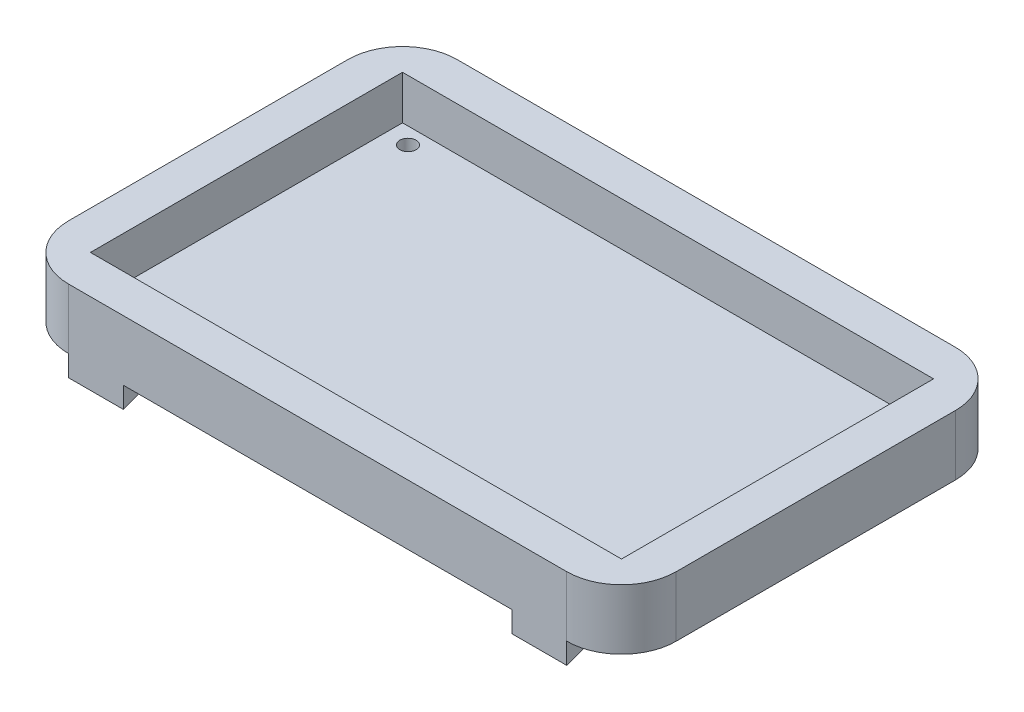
from build123d import *

# Parameters (mm, degrees)
ESQUISSE1_W             = 97
ESQUISSE1_H             = 57
BOSS_EXTRU_1_DEPTH      = 3
ESQUISSE3_W             = 7
ESQUISSE3_H             = 57
BOSS_EXTRU_2_DEPTH      = 11
ESQUISSE4_W             = 104
ESQUISSE4_H             = 7
BOSS_EXTRU_3_DEPTH      = 11
ESQUISSE5_W             = 104
ESQUISSE5_H             = 7
BOSS_EXTRU_4_DEPTH      = 11
ESQUISSE6_W             = 7
ESQUISSE6_H             = 71
BOSS_EXTRU_5_DEPTH      = 11
ESQUISSE7_R             = 1.5
ENL_V_MAT_EXTRU_3_DEPTH = 11
CONG_1_R                = 10
ESQUISSE8_W             = 10
ESQUISSE8_H             = 3.697521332
BOSS_EXTRU_6_DEPTH      = 5
ENL_V_MAT_EXTRU_5_DEPTH = 109


with BuildPart() as part:
    # Esquisse1 → Boss.-Extru.1 (new body)
    with BuildSketch(Plane(origin=(0, 0, 0), x_dir=(1, 0, 0), z_dir=(0, 1, 0))):
        with Locations((8.035502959, -3.532544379)):
            Rectangle(ESQUISSE1_W, ESQUISSE1_H)
    extrude(amount=BOSS_EXTRU_1_DEPTH)

    # Esquisse3 → Boss.-Extru.2 (add)
    with BuildSketch(Plane(origin=(0, 0, 0), x_dir=(1, 0, 0), z_dir=(0, 1, 0))):
        with Locations((-43.964497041, -3.532544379)):
            Rectangle(ESQUISSE3_W, ESQUISSE3_H)
    extrude(amount=BOSS_EXTRU_2_DEPTH)

    # Esquisse4 → Boss.-Extru.3 (add)
    with BuildSketch(Plane(origin=(0, 0, 0), x_dir=(1, 0, 0), z_dir=(0, 1, 0))):
        with Locations((4.535502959, -35.532544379)):
            Rectangle(ESQUISSE4_W, ESQUISSE4_H)
    extrude(amount=BOSS_EXTRU_3_DEPTH)

    # Esquisse5 → Boss.-Extru.4 (add)
    with BuildSketch(Plane(origin=(0, 0, 0), x_dir=(1, 0, 0), z_dir=(0, 1, 0))):
        with Locations((4.535502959, 28.467455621)):
            Rectangle(ESQUISSE5_W, ESQUISSE5_H)
    extrude(amount=BOSS_EXTRU_4_DEPTH)

    # Esquisse6 → Boss.-Extru.5 (add)
    with BuildSketch(Plane(origin=(0, 0, 0), x_dir=(1, 0, 0), z_dir=(0, 1, 0))):
        with Locations((60.035502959, -3.532544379)):
            Rectangle(ESQUISSE6_W, ESQUISSE6_H)
    extrude(amount=BOSS_EXTRU_5_DEPTH)

    # Esquisse7 → Enl_v. mat.-Extru.3 (cut)
    with BuildSketch(Plane(origin=(0, 3, 0), x_dir=(1, 0, 0), z_dir=(0, 1, 0))):
        with Locations(Location((-36.464497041, 21.967455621, 0), (0, 0, 270))):
            Circle(ESQUISSE7_R)
        with Locations(Location((-36.470473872, -29.025995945, 0), (0, 0, 270))):
            Circle(ESQUISSE7_R)
        with Locations(Location((52.535502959, 21.967455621, 0), (0, 0, 270))):
            Circle(ESQUISSE7_R)
        with Locations(Location((52.535502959, -28.683391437, 0), (0, 0, 270))):
            Circle(ESQUISSE7_R)
    extrude(amount=-ENL_V_MAT_EXTRU_3_DEPTH, mode=Mode.SUBTRACT)

    # Cong_1
    cong_1_edges = [part.edges().sort_by_distance(p)[0] for p in [
        (-47.464497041, 5.5, 39.032544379),
        (-47.464497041, 5.5, -31.967455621),
        (63.535502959, 5.5, 39.032544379),
        (63.535502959, 5.5, -31.967455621),
    ]]
    fillet(cong_1_edges, radius=CONG_1_R)

    # Esquisse8 → Boss.-Extru.6 (add)
    with BuildSketch(Plane.XZ):
        with Locations((-32.464497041, 37.183783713)):
            Rectangle(ESQUISSE8_W, ESQUISSE8_H)
        with Locations((48.535502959, 37.183783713)):
            Rectangle(ESQUISSE8_W, ESQUISSE8_H)
    extrude(amount=BOSS_EXTRU_6_DEPTH)

    # Esquisse11 → Enl_v. mat.-Extru.5 (cut)
    with BuildSketch(Plane.ZY.offset(37.464497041)):
        Polygon((35.335023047, -2.5), (39.032544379, -3.827955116), (39.032544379, -5), (35.335023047, -5), align=None)
    extrude(amount=-ENL_V_MAT_EXTRU_5_DEPTH, mode=Mode.SUBTRACT)


solid = part.part
